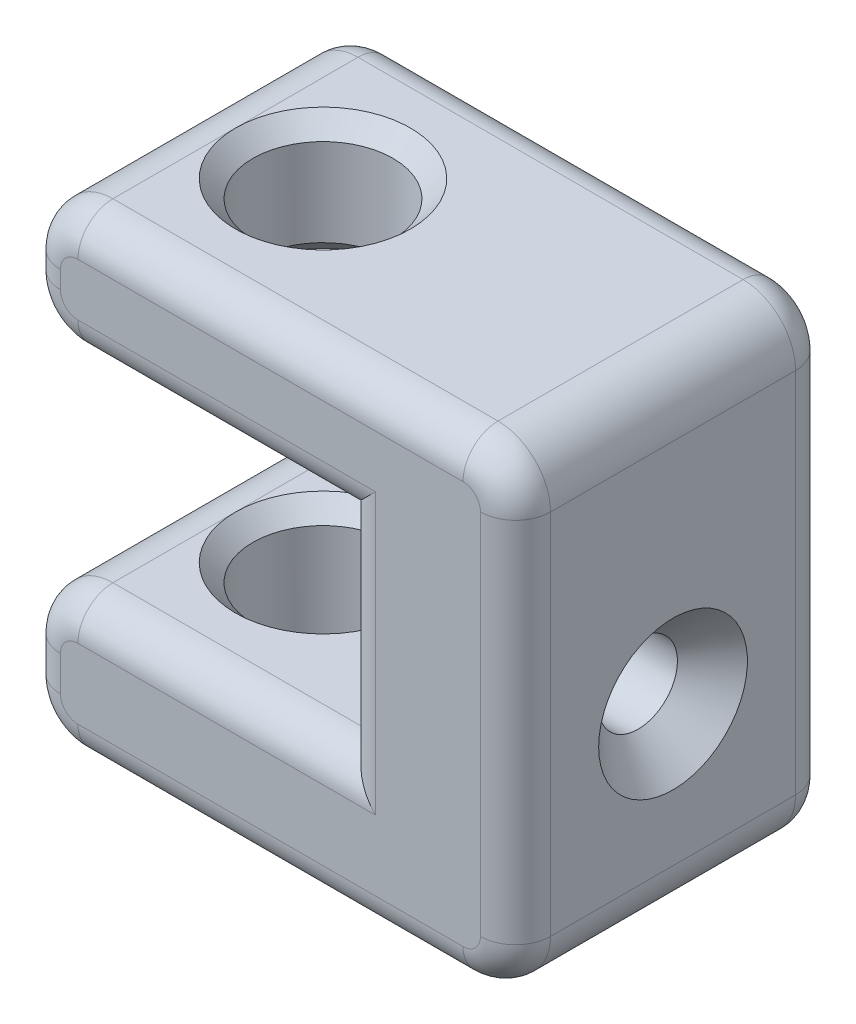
ISO-10303-21;
HEADER;
FILE_DESCRIPTION(('STEP AP214'),'2;1');
FILE_NAME('part.step','',(''),(''),'','','');
FILE_SCHEMA(('AUTOMOTIVE_DESIGN { 1 0 10303 214 1 1 1 1 }'));
ENDSEC;
DATA;
#1=APPLICATION_CONTEXT('core data for automotive mechanical design processes');
#2=APPLICATION_PROTOCOL_DEFINITION('international standard','automotive_design',2000,#1);
#3=PRODUCT_CONTEXT('',#1,'mechanical');
#4=PRODUCT('Part','Part','',(#3));
#5=PRODUCT_RELATED_PRODUCT_CATEGORY('part','',(#4));
#6=PRODUCT_DEFINITION_FORMATION('','',#4);
#7=PRODUCT_DEFINITION_CONTEXT('part definition',#1,'design');
#8=PRODUCT_DEFINITION('design','',#6,#7);
#9=PRODUCT_DEFINITION_SHAPE('','',#8);
#10=(LENGTH_UNIT() NAMED_UNIT(*) SI_UNIT(.MILLI.,.METRE.));
#11=(NAMED_UNIT(*) PLANE_ANGLE_UNIT() SI_UNIT($,.RADIAN.));
#12=(NAMED_UNIT(*) SI_UNIT($,.STERADIAN.) SOLID_ANGLE_UNIT());
#13=UNCERTAINTY_MEASURE_WITH_UNIT(LENGTH_MEASURE(1.E-05),#10,'distance_accuracy_value','');
#14=(GEOMETRIC_REPRESENTATION_CONTEXT(3) GLOBAL_UNCERTAINTY_ASSIGNED_CONTEXT((#13)) GLOBAL_UNIT_ASSIGNED_CONTEXT((#10,
#11,#12)) REPRESENTATION_CONTEXT('',''));
#15=CARTESIAN_POINT('',(0.,0.,0.));
#16=DIRECTION('',(0.,0.,1.));
#17=DIRECTION('',(1.,0.,0.));
#18=AXIS2_PLACEMENT_3D('',#15,#16,#17);
#19=CARTESIAN_POINT('',(0.,7.,18.));
#20=DIRECTION('',(1.,0.,0.));
#21=DIRECTION('',(0.,1.,0.));
#22=AXIS2_PLACEMENT_3D('',#19,#20,#21);
#23=PLANE('',#22);
#24=DIRECTION('',(0.,0.,-1.));
#25=VECTOR('',#24,1.);
#26=CARTESIAN_POINT('',(0.,4.,18.));
#27=LINE('',#26,#25);
#28=CARTESIAN_POINT('',(0.,4.,16.));
#29=VERTEX_POINT('',#28);
#30=CARTESIAN_POINT('',(0.,4.,2.));
#31=VERTEX_POINT('',#30);
#32=EDGE_CURVE('E263',#29,#31,#27,.T.);
#33=ORIENTED_EDGE('',*,*,#32,.T.);
#34=DIRECTION('',(0.,-1.,0.));
#35=VECTOR('',#34,1.);
#36=CARTESIAN_POINT('',(0.,7.,2.));
#37=LINE('',#36,#35);
#38=CARTESIAN_POINT('',(0.,3.,2.));
#39=VERTEX_POINT('',#38);
#40=EDGE_CURVE('E415',#31,#39,#37,.T.);
#41=ORIENTED_EDGE('',*,*,#40,.T.);
#42=DIRECTION('',(0.,0.,-1.));
#43=VECTOR('',#42,1.);
#44=CARTESIAN_POINT('',(0.,3.,18.));
#45=LINE('',#44,#43);
#46=CARTESIAN_POINT('',(0.,3.,16.));
#47=VERTEX_POINT('',#46);
#48=EDGE_CURVE('E261',#39,#47,#45,.F.);
#49=ORIENTED_EDGE('',*,*,#48,.T.);
#50=DIRECTION('',(0.,-1.,0.));
#51=VECTOR('',#50,1.);
#52=CARTESIAN_POINT('',(0.,4.,16.));
#53=LINE('',#52,#51);
#54=EDGE_CURVE('E331',#47,#29,#53,.F.);
#55=ORIENTED_EDGE('',*,*,#54,.T.);
#56=EDGE_LOOP('',(#33,#41,#49,#55));
#57=FACE_BOUND('',#56,.T.);
#58=ADVANCED_FACE('F33',(#57),#23,.F.);
#59=CARTESIAN_POINT('',(0.,0.,18.));
#60=DIRECTION('',(0.,1.,0.));
#61=DIRECTION('',(0.,0.,1.));
#62=AXIS2_PLACEMENT_3D('',#59,#60,#61);
#63=PLANE('',#62);
#64=DIRECTION('',(0.,0.,-1.));
#65=VECTOR('',#64,1.);
#66=CARTESIAN_POINT('',(3.,0.,18.));
#67=LINE('',#66,#65);
#68=CARTESIAN_POINT('',(3.,0.,9.));
#69=VERTEX_POINT('',#68);
#70=CARTESIAN_POINT('',(3.,0.,2.));
#71=VERTEX_POINT('',#70);
#72=EDGE_CURVE('E266',#69,#71,#67,.T.);
#73=ORIENTED_EDGE('',*,*,#72,.T.);
#74=DIRECTION('',(1.,0.,0.));
#75=VECTOR('',#74,1.);
#76=CARTESIAN_POINT('',(0.,0.,2.));
#77=LINE('',#76,#75);
#78=CARTESIAN_POINT('',(18.,0.,2.));
#79=VERTEX_POINT('',#78);
#80=EDGE_CURVE('E419',#71,#79,#77,.T.);
#81=ORIENTED_EDGE('',*,*,#80,.T.);
#82=DIRECTION('',(0.,0.,-1.));
#83=VECTOR('',#82,1.);
#84=CARTESIAN_POINT('',(18.,0.,18.));
#85=LINE('',#84,#83);
#86=CARTESIAN_POINT('',(18.,0.,16.));
#87=VERTEX_POINT('',#86);
#88=EDGE_CURVE('E539',#87,#79,#85,.T.);
#89=ORIENTED_EDGE('',*,*,#88,.F.);
#90=DIRECTION('',(1.,0.,0.));
#91=VECTOR('',#90,1.);
#92=CARTESIAN_POINT('',(3.,0.,16.));
#93=LINE('',#92,#91);
#94=CARTESIAN_POINT('',(3.,0.,16.));
#95=VERTEX_POINT('',#94);
#96=EDGE_CURVE('E326',#87,#95,#93,.F.);
#97=ORIENTED_EDGE('',*,*,#96,.T.);
#98=DIRECTION('',(0.,0.,-1.));
#99=VECTOR('',#98,1.);
#100=CARTESIAN_POINT('',(3.,0.,18.));
#101=LINE('',#100,#99);
#102=EDGE_CURVE('E269',#95,#69,#101,.T.);
#103=ORIENTED_EDGE('',*,*,#102,.T.);
#104=CARTESIAN_POINT('',(8.,0.,9.));
#105=DIRECTION('',(0.,1.,0.));
#106=DIRECTION('',(0.,0.,1.));
#107=AXIS2_PLACEMENT_3D('',#104,#105,#106);
#108=CIRCLE('',#107,5.);
#109=EDGE_CURVE('E566',#69,#69,#108,.T.);
#110=ORIENTED_EDGE('',*,*,#109,.T.);
#111=EDGE_LOOP('',(#73,#81,#89,#97,#103,#110));
#112=FACE_BOUND('',#111,.T.);
#113=ADVANCED_FACE('F544',(#112),#63,.F.);
#114=CARTESIAN_POINT('',(18.,0.,18.));
#115=DIRECTION('',(1.,0.,0.));
#116=DIRECTION('',(0.,1.,0.));
#117=AXIS2_PLACEMENT_3D('',#114,#115,#116);
#118=PLANE('',#117);
#119=CARTESIAN_POINT('',(18.,-9.,9.));
#120=DIRECTION('',(1.,0.,0.));
#121=DIRECTION('',(0.,1.,0.));
#122=AXIS2_PLACEMENT_3D('',#119,#120,#121);
#123=CIRCLE('',#122,2.25);
#124=CARTESIAN_POINT('',(18.,-6.75,9.));
#125=VERTEX_POINT('',#124);
#126=EDGE_CURVE('E384',#125,#125,#123,.T.);
#127=ORIENTED_EDGE('',*,*,#126,.T.);
#128=EDGE_LOOP('',(#127));
#129=FACE_BOUND('',#128,.T.);
#130=ORIENTED_EDGE('',*,*,#88,.T.);
#131=DIRECTION('',(0.,-1.,0.));
#132=VECTOR('',#131,1.);
#133=CARTESIAN_POINT('',(18.,0.,2.));
#134=LINE('',#133,#132);
#135=CARTESIAN_POINT('',(18.,-12.,2.));
#136=VERTEX_POINT('',#135);
#137=EDGE_CURVE('E421',#79,#136,#134,.T.);
#138=ORIENTED_EDGE('',*,*,#137,.T.);
#139=DIRECTION('',(0.,0.,-1.));
#140=VECTOR('',#139,1.);
#141=CARTESIAN_POINT('',(18.,-12.,18.));
#142=LINE('',#141,#140);
#143=CARTESIAN_POINT('',(18.,-12.,16.));
#144=VERTEX_POINT('',#143);
#145=EDGE_CURVE('E541',#144,#136,#142,.T.);
#146=ORIENTED_EDGE('',*,*,#145,.F.);
#147=DIRECTION('',(0.,-1.,0.));
#148=VECTOR('',#147,1.);
#149=CARTESIAN_POINT('',(18.,0.,16.));
#150=LINE('',#149,#148);
#151=EDGE_CURVE('E324',#144,#87,#150,.F.);
#152=ORIENTED_EDGE('',*,*,#151,.T.);
#153=EDGE_LOOP('',(#130,#138,#146,#152));
#154=FACE_BOUND('',#153,.T.);
#155=ADVANCED_FACE('F538',(#129,#154),#118,.F.);
#156=CARTESIAN_POINT('',(18.,-12.,18.));
#157=DIRECTION('',(0.,-1.,0.));
#158=DIRECTION('',(0.,0.,-1.));
#159=AXIS2_PLACEMENT_3D('',#156,#157,#158);
#160=PLANE('',#159);
#161=ORIENTED_EDGE('',*,*,#145,.T.);
#162=DIRECTION('',(-1.,0.,0.));
#163=VECTOR('',#162,1.);
#164=CARTESIAN_POINT('',(18.,-12.,2.));
#165=LINE('',#164,#163);
#166=CARTESIAN_POINT('',(3.,-12.,2.));
#167=VERTEX_POINT('',#166);
#168=EDGE_CURVE('E423',#136,#167,#165,.T.);
#169=ORIENTED_EDGE('',*,*,#168,.T.);
#170=DIRECTION('',(0.,0.,-1.));
#171=VECTOR('',#170,1.);
#172=CARTESIAN_POINT('',(3.,-12.,18.));
#173=LINE('',#172,#171);
#174=CARTESIAN_POINT('',(3.,-12.,9.));
#175=VERTEX_POINT('',#174);
#176=EDGE_CURVE('E279',#167,#175,#173,.F.);
#177=ORIENTED_EDGE('',*,*,#176,.T.);
#178=CARTESIAN_POINT('',(8.,-12.,9.));
#179=DIRECTION('',(0.,-1.,0.));
#180=DIRECTION('',(0.,0.,-1.));
#181=AXIS2_PLACEMENT_3D('',#178,#179,#180);
#182=CIRCLE('',#181,5.);
#183=EDGE_CURVE('E526',#175,#175,#182,.T.);
#184=ORIENTED_EDGE('',*,*,#183,.T.);
#185=DIRECTION('',(0.,0.,-1.));
#186=VECTOR('',#185,1.);
#187=CARTESIAN_POINT('',(3.,-12.,18.));
#188=LINE('',#187,#186);
#189=CARTESIAN_POINT('',(3.,-12.,16.));
#190=VERTEX_POINT('',#189);
#191=EDGE_CURVE('E276',#175,#190,#188,.F.);
#192=ORIENTED_EDGE('',*,*,#191,.T.);
#193=DIRECTION('',(-1.,0.,0.));
#194=VECTOR('',#193,1.);
#195=CARTESIAN_POINT('',(18.,-12.,16.));
#196=LINE('',#195,#194);
#197=EDGE_CURVE('E322',#190,#144,#196,.F.);
#198=ORIENTED_EDGE('',*,*,#197,.T.);
#199=EDGE_LOOP('',(#161,#169,#177,#184,#192,#198));
#200=FACE_BOUND('',#199,.T.);
#201=ADVANCED_FACE('F523',(#200),#160,.F.);
#202=CARTESIAN_POINT('',(0.,-12.,18.));
#203=DIRECTION('',(1.,0.,0.));
#204=DIRECTION('',(0.,1.,0.));
#205=AXIS2_PLACEMENT_3D('',#202,#203,#204);
#206=PLANE('',#205);
#207=DIRECTION('',(0.,0.,-1.));
#208=VECTOR('',#207,1.);
#209=CARTESIAN_POINT('',(0.,-15.,18.));
#210=LINE('',#209,#208);
#211=CARTESIAN_POINT('',(0.,-15.,16.));
#212=VERTEX_POINT('',#211);
#213=CARTESIAN_POINT('',(0.,-15.,2.));
#214=VERTEX_POINT('',#213);
#215=EDGE_CURVE('E273',#212,#214,#210,.T.);
#216=ORIENTED_EDGE('',*,*,#215,.T.);
#217=DIRECTION('',(0.,-1.,0.));
#218=VECTOR('',#217,1.);
#219=CARTESIAN_POINT('',(0.,-12.,2.));
#220=LINE('',#219,#218);
#221=CARTESIAN_POINT('',(0.,-17.,2.));
#222=VERTEX_POINT('',#221);
#223=EDGE_CURVE('E427',#214,#222,#220,.T.);
#224=ORIENTED_EDGE('',*,*,#223,.T.);
#225=DIRECTION('',(0.,0.,-1.));
#226=VECTOR('',#225,1.);
#227=CARTESIAN_POINT('',(0.,-17.,18.));
#228=LINE('',#227,#226);
#229=CARTESIAN_POINT('',(0.,-17.,16.));
#230=VERTEX_POINT('',#229);
#231=EDGE_CURVE('E271',#222,#230,#228,.F.);
#232=ORIENTED_EDGE('',*,*,#231,.T.);
#233=DIRECTION('',(0.,-1.,0.));
#234=VECTOR('',#233,1.);
#235=CARTESIAN_POINT('',(0.,-15.,16.));
#236=LINE('',#235,#234);
#237=EDGE_CURVE('E318',#230,#212,#236,.F.);
#238=ORIENTED_EDGE('',*,*,#237,.T.);
#239=EDGE_LOOP('',(#216,#224,#232,#238));
#240=FACE_BOUND('',#239,.T.);
#241=ADVANCED_FACE('F488',(#240),#206,.F.);
#242=CARTESIAN_POINT('',(0.,-20.,18.));
#243=DIRECTION('',(0.,1.,0.));
#244=DIRECTION('',(0.,0.,1.));
#245=AXIS2_PLACEMENT_3D('',#242,#243,#244);
#246=PLANE('',#245);
#247=DIRECTION('',(0.,0.,-1.));
#248=VECTOR('',#247,1.);
#249=CARTESIAN_POINT('',(3.,-20.,18.));
#250=LINE('',#249,#248);
#251=CARTESIAN_POINT('',(3.,-20.,9.));
#252=VERTEX_POINT('',#251);
#253=CARTESIAN_POINT('',(3.,-20.,2.));
#254=VERTEX_POINT('',#253);
#255=EDGE_CURVE('E254',#252,#254,#250,.T.);
#256=ORIENTED_EDGE('',*,*,#255,.T.);
#257=DIRECTION('',(1.,0.,0.));
#258=VECTOR('',#257,1.);
#259=CARTESIAN_POINT('',(0.,-20.,2.));
#260=LINE('',#259,#258);
#261=CARTESIAN_POINT('',(25.,-20.,2.));
#262=VERTEX_POINT('',#261);
#263=EDGE_CURVE('E431',#254,#262,#260,.T.);
#264=ORIENTED_EDGE('',*,*,#263,.T.);
#265=DIRECTION('',(0.,0.,-1.));
#266=VECTOR('',#265,1.);
#267=CARTESIAN_POINT('',(25.,-20.,18.));
#268=LINE('',#267,#266);
#269=CARTESIAN_POINT('',(25.,-20.,16.));
#270=VERTEX_POINT('',#269);
#271=EDGE_CURVE('E259',#262,#270,#268,.F.);
#272=ORIENTED_EDGE('',*,*,#271,.T.);
#273=DIRECTION('',(1.,0.,0.));
#274=VECTOR('',#273,1.);
#275=CARTESIAN_POINT('',(3.,-20.,16.));
#276=LINE('',#275,#274);
#277=CARTESIAN_POINT('',(3.,-20.,16.));
#278=VERTEX_POINT('',#277);
#279=EDGE_CURVE('E313',#270,#278,#276,.F.);
#280=ORIENTED_EDGE('',*,*,#279,.T.);
#281=DIRECTION('',(0.,0.,-1.));
#282=VECTOR('',#281,1.);
#283=CARTESIAN_POINT('',(3.,-20.,18.));
#284=LINE('',#283,#282);
#285=EDGE_CURVE('E257',#278,#252,#284,.T.);
#286=ORIENTED_EDGE('',*,*,#285,.T.);
#287=CARTESIAN_POINT('',(8.,-20.,9.));
#288=DIRECTION('',(0.,1.,0.));
#289=DIRECTION('',(0.,0.,1.));
#290=AXIS2_PLACEMENT_3D('',#287,#288,#289);
#291=CIRCLE('',#290,5.00000000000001);
#292=EDGE_CURVE('E547',#252,#252,#291,.T.);
#293=ORIENTED_EDGE('',*,*,#292,.T.);
#294=EDGE_LOOP('',(#256,#264,#272,#280,#286,#293));
#295=FACE_BOUND('',#294,.T.);
#296=ADVANCED_FACE('F649',(#295),#246,.F.);
#297=CARTESIAN_POINT('',(28.,-20.,18.));
#298=DIRECTION('',(-1.,0.,0.));
#299=DIRECTION('',(0.,0.,1.));
#300=AXIS2_PLACEMENT_3D('',#297,#298,#299);
#301=PLANE('',#300);
#302=CARTESIAN_POINT('',(28.,-9.,9.));
#303=DIRECTION('',(-1.,0.,0.));
#304=DIRECTION('',(0.,0.,1.));
#305=AXIS2_PLACEMENT_3D('',#302,#303,#304);
#306=CIRCLE('',#305,4.25000000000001);
#307=CARTESIAN_POINT('',(28.,-9.,13.25));
#308=VERTEX_POINT('',#307);
#309=EDGE_CURVE('E247',#308,#308,#306,.T.);
#310=ORIENTED_EDGE('',*,*,#309,.T.);
#311=EDGE_LOOP('',(#310));
#312=FACE_BOUND('',#311,.T.);
#313=DIRECTION('',(0.,0.,-1.));
#314=VECTOR('',#313,1.);
#315=CARTESIAN_POINT('',(28.,-17.,18.));
#316=LINE('',#315,#314);
#317=CARTESIAN_POINT('',(28.,-17.,16.));
#318=VERTEX_POINT('',#317);
#319=CARTESIAN_POINT('',(28.,-17.,2.));
#320=VERTEX_POINT('',#319);
#321=EDGE_CURVE('E245',#318,#320,#316,.T.);
#322=ORIENTED_EDGE('',*,*,#321,.T.);
#323=DIRECTION('',(0.,1.,0.));
#324=VECTOR('',#323,1.);
#325=CARTESIAN_POINT('',(28.,-20.,2.));
#326=LINE('',#325,#324);
#327=CARTESIAN_POINT('',(28.,4.,2.));
#328=VERTEX_POINT('',#327);
#329=EDGE_CURVE('E57',#320,#328,#326,.T.);
#330=ORIENTED_EDGE('',*,*,#329,.T.);
#331=DIRECTION('',(0.,0.,-1.));
#332=VECTOR('',#331,1.);
#333=CARTESIAN_POINT('',(28.,4.,18.));
#334=LINE('',#333,#332);
#335=CARTESIAN_POINT('',(28.,4.,16.));
#336=VERTEX_POINT('',#335);
#337=EDGE_CURVE('E252',#328,#336,#334,.F.);
#338=ORIENTED_EDGE('',*,*,#337,.T.);
#339=DIRECTION('',(0.,1.,0.));
#340=VECTOR('',#339,1.);
#341=CARTESIAN_POINT('',(28.,-17.,16.));
#342=LINE('',#341,#340);
#343=EDGE_CURVE('E340',#336,#318,#342,.F.);
#344=ORIENTED_EDGE('',*,*,#343,.T.);
#345=EDGE_LOOP('',(#322,#330,#338,#344));
#346=FACE_BOUND('',#345,.T.);
#347=ADVANCED_FACE('F588',(#312,#346),#301,.F.);
#348=CARTESIAN_POINT('',(28.,7.,18.));
#349=DIRECTION('',(0.,-1.,0.));
#350=DIRECTION('',(1.,0.,0.));
#351=AXIS2_PLACEMENT_3D('',#348,#349,#350);
#352=PLANE('',#351);
#353=DIRECTION('',(0.,0.,-1.));
#354=VECTOR('',#353,1.);
#355=CARTESIAN_POINT('',(25.,7.,18.));
#356=LINE('',#355,#354);
#357=CARTESIAN_POINT('',(25.,7.,16.));
#358=VERTEX_POINT('',#357);
#359=CARTESIAN_POINT('',(25.,7.,2.));
#360=VERTEX_POINT('',#359);
#361=EDGE_CURVE('E242',#358,#360,#356,.T.);
#362=ORIENTED_EDGE('',*,*,#361,.T.);
#363=DIRECTION('',(-1.,0.,0.));
#364=VECTOR('',#363,1.);
#365=CARTESIAN_POINT('',(28.,7.,2.));
#366=LINE('',#365,#364);
#367=CARTESIAN_POINT('',(3.,7.,2.));
#368=VERTEX_POINT('',#367);
#369=EDGE_CURVE('E11',#360,#368,#366,.T.);
#370=ORIENTED_EDGE('',*,*,#369,.T.);
#371=DIRECTION('',(0.,0.,-1.));
#372=VECTOR('',#371,1.);
#373=CARTESIAN_POINT('',(3.,7.,18.));
#374=LINE('',#373,#372);
#375=CARTESIAN_POINT('',(3.,7.,9.));
#376=VERTEX_POINT('',#375);
#377=EDGE_CURVE('E232',#368,#376,#374,.F.);
#378=ORIENTED_EDGE('',*,*,#377,.T.);
#379=CARTESIAN_POINT('',(8.,7.,9.));
#380=DIRECTION('',(0.,-1.,0.));
#381=DIRECTION('',(1.,0.,0.));
#382=AXIS2_PLACEMENT_3D('',#379,#380,#381);
#383=CIRCLE('',#382,5.00000000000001);
#384=EDGE_CURVE('E236',#376,#376,#383,.T.);
#385=ORIENTED_EDGE('',*,*,#384,.T.);
#386=DIRECTION('',(0.,0.,-1.));
#387=VECTOR('',#386,1.);
#388=CARTESIAN_POINT('',(3.,7.,18.));
#389=LINE('',#388,#387);
#390=CARTESIAN_POINT('',(3.,7.,16.));
#391=VERTEX_POINT('',#390);
#392=EDGE_CURVE('E243',#376,#391,#389,.F.);
#393=ORIENTED_EDGE('',*,*,#392,.T.);
#394=DIRECTION('',(-1.,0.,0.));
#395=VECTOR('',#394,1.);
#396=CARTESIAN_POINT('',(25.,7.,16.));
#397=LINE('',#396,#395);
#398=EDGE_CURVE('E335',#391,#358,#397,.F.);
#399=ORIENTED_EDGE('',*,*,#398,.T.);
#400=EDGE_LOOP('',(#362,#370,#378,#385,#393,#399));
#401=FACE_BOUND('',#400,.T.);
#402=ADVANCED_FACE('F233',(#401),#352,.F.);
#403=CARTESIAN_POINT('',(0.,0.,18.));
#404=DIRECTION('',(0.,0.,1.));
#405=DIRECTION('',(1.,0.,0.));
#406=AXIS2_PLACEMENT_3D('',#403,#404,#405);
#407=PLANE('',#406);
#408=DIRECTION('',(1.,0.,0.));
#409=VECTOR('',#408,1.);
#410=CARTESIAN_POINT('',(25.,-18.,18.));
#411=LINE('',#410,#409);
#412=CARTESIAN_POINT('',(3.,-18.,18.));
#413=VERTEX_POINT('',#412);
#414=CARTESIAN_POINT('',(25.,-18.,18.));
#415=VERTEX_POINT('',#414);
#416=EDGE_CURVE('E305',#413,#415,#411,.T.);
#417=ORIENTED_EDGE('',*,*,#416,.T.);
#418=CARTESIAN_POINT('',(25.,-17.,18.));
#419=DIRECTION('',(0.,0.,1.));
#420=DIRECTION('',(1.,0.,0.));
#421=AXIS2_PLACEMENT_3D('',#418,#419,#420);
#422=CIRCLE('',#421,1.);
#423=CARTESIAN_POINT('',(26.,-17.,18.));
#424=VERTEX_POINT('',#423);
#425=EDGE_CURVE('E307',#415,#424,#422,.T.);
#426=ORIENTED_EDGE('',*,*,#425,.T.);
#427=DIRECTION('',(0.,1.,0.));
#428=VECTOR('',#427,1.);
#429=CARTESIAN_POINT('',(26.,4.,18.));
#430=LINE('',#429,#428);
#431=CARTESIAN_POINT('',(26.,4.,18.));
#432=VERTEX_POINT('',#431);
#433=EDGE_CURVE('E281',#424,#432,#430,.T.);
#434=ORIENTED_EDGE('',*,*,#433,.T.);
#435=CARTESIAN_POINT('',(25.,4.,18.));
#436=DIRECTION('',(0.,0.,1.));
#437=DIRECTION('',(1.,0.,0.));
#438=AXIS2_PLACEMENT_3D('',#435,#436,#437);
#439=CIRCLE('',#438,1.);
#440=CARTESIAN_POINT('',(25.,5.,18.));
#441=VERTEX_POINT('',#440);
#442=EDGE_CURVE('E283',#432,#441,#439,.T.);
#443=ORIENTED_EDGE('',*,*,#442,.T.);
#444=DIRECTION('',(-1.,0.,0.));
#445=VECTOR('',#444,1.);
#446=CARTESIAN_POINT('',(3.,5.,18.));
#447=LINE('',#446,#445);
#448=CARTESIAN_POINT('',(3.,5.,18.));
#449=VERTEX_POINT('',#448);
#450=EDGE_CURVE('E285',#441,#449,#447,.T.);
#451=ORIENTED_EDGE('',*,*,#450,.T.);
#452=CARTESIAN_POINT('',(3.,4.,18.));
#453=DIRECTION('',(0.,0.,1.));
#454=DIRECTION('',(1.,0.,0.));
#455=AXIS2_PLACEMENT_3D('',#452,#453,#454);
#456=CIRCLE('',#455,1.);
#457=CARTESIAN_POINT('',(2.,4.,18.));
#458=VERTEX_POINT('',#457);
#459=EDGE_CURVE('E287',#449,#458,#456,.T.);
#460=ORIENTED_EDGE('',*,*,#459,.T.);
#461=DIRECTION('',(0.,-1.,0.));
#462=VECTOR('',#461,1.);
#463=CARTESIAN_POINT('',(2.,3.,18.));
#464=LINE('',#463,#462);
#465=CARTESIAN_POINT('',(2.,3.,18.));
#466=VERTEX_POINT('',#465);
#467=EDGE_CURVE('E289',#458,#466,#464,.T.);
#468=ORIENTED_EDGE('',*,*,#467,.T.);
#469=CARTESIAN_POINT('',(3.,3.,18.));
#470=DIRECTION('',(0.,0.,1.));
#471=DIRECTION('',(1.,0.,0.));
#472=AXIS2_PLACEMENT_3D('',#469,#470,#471);
#473=CIRCLE('',#472,1.);
#474=CARTESIAN_POINT('',(3.,2.,18.));
#475=VERTEX_POINT('',#474);
#476=EDGE_CURVE('E291',#466,#475,#473,.T.);
#477=ORIENTED_EDGE('',*,*,#476,.T.);
#478=DIRECTION('',(1.,0.,0.));
#479=VECTOR('',#478,1.);
#480=CARTESIAN_POINT('',(18.,2.,18.));
#481=LINE('',#480,#479);
#482=CARTESIAN_POINT('',(20.,2.,18.));
#483=VERTEX_POINT('',#482);
#484=EDGE_CURVE('E293',#475,#483,#481,.T.);
#485=ORIENTED_EDGE('',*,*,#484,.T.);
#486=DIRECTION('',(0.,-1.,0.));
#487=VECTOR('',#486,1.);
#488=CARTESIAN_POINT('',(20.,-12.,18.));
#489=LINE('',#488,#487);
#490=CARTESIAN_POINT('',(20.,-14.,18.));
#491=VERTEX_POINT('',#490);
#492=EDGE_CURVE('E295',#483,#491,#489,.T.);
#493=ORIENTED_EDGE('',*,*,#492,.T.);
#494=DIRECTION('',(-1.,0.,0.));
#495=VECTOR('',#494,1.);
#496=CARTESIAN_POINT('',(3.,-14.,18.));
#497=LINE('',#496,#495);
#498=CARTESIAN_POINT('',(3.,-14.,18.));
#499=VERTEX_POINT('',#498);
#500=EDGE_CURVE('E297',#491,#499,#497,.T.);
#501=ORIENTED_EDGE('',*,*,#500,.T.);
#502=CARTESIAN_POINT('',(3.,-15.,18.));
#503=DIRECTION('',(0.,0.,1.));
#504=DIRECTION('',(1.,0.,0.));
#505=AXIS2_PLACEMENT_3D('',#502,#503,#504);
#506=CIRCLE('',#505,1.);
#507=CARTESIAN_POINT('',(2.,-15.,18.));
#508=VERTEX_POINT('',#507);
#509=EDGE_CURVE('E299',#499,#508,#506,.T.);
#510=ORIENTED_EDGE('',*,*,#509,.T.);
#511=DIRECTION('',(0.,-1.,0.));
#512=VECTOR('',#511,1.);
#513=CARTESIAN_POINT('',(2.,-17.,18.));
#514=LINE('',#513,#512);
#515=CARTESIAN_POINT('',(2.,-17.,18.));
#516=VERTEX_POINT('',#515);
#517=EDGE_CURVE('E301',#508,#516,#514,.T.);
#518=ORIENTED_EDGE('',*,*,#517,.T.);
#519=CARTESIAN_POINT('',(3.,-17.,18.));
#520=DIRECTION('',(0.,0.,1.));
#521=DIRECTION('',(1.,0.,0.));
#522=AXIS2_PLACEMENT_3D('',#519,#520,#521);
#523=CIRCLE('',#522,1.);
#524=EDGE_CURVE('E303',#516,#413,#523,.T.);
#525=ORIENTED_EDGE('',*,*,#524,.T.);
#526=EDGE_LOOP('',(#417,#426,#434,#443,#451,#460,#468,#477,#485,#493,#501,#510,#518,#525));
#527=FACE_BOUND('',#526,.T.);
#528=ADVANCED_FACE('F507',(#527),#407,.T.);
#529=CARTESIAN_POINT('',(0.,0.,0.));
#530=DIRECTION('',(0.,0.,1.));
#531=DIRECTION('',(1.,0.,0.));
#532=AXIS2_PLACEMENT_3D('',#529,#530,#531);
#533=PLANE('',#532);
#534=DIRECTION('',(0.,-1.,0.));
#535=VECTOR('',#534,1.);
#536=CARTESIAN_POINT('',(2.,0.,0.));
#537=LINE('',#536,#535);
#538=CARTESIAN_POINT('',(2.,3.,0.));
#539=VERTEX_POINT('',#538);
#540=CARTESIAN_POINT('',(2.,4.,0.));
#541=VERTEX_POINT('',#540);
#542=EDGE_CURVE('E408',#539,#541,#537,.F.);
#543=ORIENTED_EDGE('',*,*,#542,.T.);
#544=CARTESIAN_POINT('',(3.,4.,0.));
#545=DIRECTION('',(0.,0.,1.));
#546=DIRECTION('',(1.,0.,0.));
#547=AXIS2_PLACEMENT_3D('',#544,#545,#546);
#548=CIRCLE('',#547,1.);
#549=CARTESIAN_POINT('',(3.,5.,0.));
#550=VERTEX_POINT('',#549);
#551=EDGE_CURVE('E410',#541,#550,#548,.F.);
#552=ORIENTED_EDGE('',*,*,#551,.T.);
#553=DIRECTION('',(-1.,0.,0.));
#554=VECTOR('',#553,1.);
#555=CARTESIAN_POINT('',(0.,5.,0.));
#556=LINE('',#555,#554);
#557=CARTESIAN_POINT('',(25.,5.,0.));
#558=VERTEX_POINT('',#557);
#559=EDGE_CURVE('E342',#550,#558,#556,.F.);
#560=ORIENTED_EDGE('',*,*,#559,.T.);
#561=CARTESIAN_POINT('',(25.,4.,0.));
#562=DIRECTION('',(0.,0.,1.));
#563=DIRECTION('',(1.,0.,0.));
#564=AXIS2_PLACEMENT_3D('',#561,#562,#563);
#565=CIRCLE('',#564,1.);
#566=CARTESIAN_POINT('',(26.,4.,0.));
#567=VERTEX_POINT('',#566);
#568=EDGE_CURVE('E386',#558,#567,#565,.F.);
#569=ORIENTED_EDGE('',*,*,#568,.T.);
#570=DIRECTION('',(0.,1.,0.));
#571=VECTOR('',#570,1.);
#572=CARTESIAN_POINT('',(26.,0.,0.));
#573=LINE('',#572,#571);
#574=CARTESIAN_POINT('',(26.,-17.,0.));
#575=VERTEX_POINT('',#574);
#576=EDGE_CURVE('E388',#567,#575,#573,.F.);
#577=ORIENTED_EDGE('',*,*,#576,.T.);
#578=CARTESIAN_POINT('',(25.,-17.,0.));
#579=DIRECTION('',(0.,0.,1.));
#580=DIRECTION('',(1.,0.,0.));
#581=AXIS2_PLACEMENT_3D('',#578,#579,#580);
#582=CIRCLE('',#581,1.);
#583=CARTESIAN_POINT('',(25.,-18.,0.));
#584=VERTEX_POINT('',#583);
#585=EDGE_CURVE('E390',#575,#584,#582,.F.);
#586=ORIENTED_EDGE('',*,*,#585,.T.);
#587=DIRECTION('',(1.,0.,0.));
#588=VECTOR('',#587,1.);
#589=CARTESIAN_POINT('',(0.,-18.,0.));
#590=LINE('',#589,#588);
#591=CARTESIAN_POINT('',(3.,-18.,0.));
#592=VERTEX_POINT('',#591);
#593=EDGE_CURVE('E392',#584,#592,#590,.F.);
#594=ORIENTED_EDGE('',*,*,#593,.T.);
#595=CARTESIAN_POINT('',(3.,-17.,0.));
#596=DIRECTION('',(0.,0.,1.));
#597=DIRECTION('',(1.,0.,0.));
#598=AXIS2_PLACEMENT_3D('',#595,#596,#597);
#599=CIRCLE('',#598,1.);
#600=CARTESIAN_POINT('',(2.,-17.,0.));
#601=VERTEX_POINT('',#600);
#602=EDGE_CURVE('E394',#592,#601,#599,.F.);
#603=ORIENTED_EDGE('',*,*,#602,.T.);
#604=DIRECTION('',(0.,-1.,0.));
#605=VECTOR('',#604,1.);
#606=CARTESIAN_POINT('',(2.,0.,0.));
#607=LINE('',#606,#605);
#608=CARTESIAN_POINT('',(2.,-15.,0.));
#609=VERTEX_POINT('',#608);
#610=EDGE_CURVE('E396',#601,#609,#607,.F.);
#611=ORIENTED_EDGE('',*,*,#610,.T.);
#612=CARTESIAN_POINT('',(3.,-15.,0.));
#613=DIRECTION('',(0.,0.,1.));
#614=DIRECTION('',(1.,0.,0.));
#615=AXIS2_PLACEMENT_3D('',#612,#613,#614);
#616=CIRCLE('',#615,1.);
#617=CARTESIAN_POINT('',(3.,-14.,0.));
#618=VERTEX_POINT('',#617);
#619=EDGE_CURVE('E398',#609,#618,#616,.F.);
#620=ORIENTED_EDGE('',*,*,#619,.T.);
#621=DIRECTION('',(-1.,0.,0.));
#622=VECTOR('',#621,1.);
#623=CARTESIAN_POINT('',(0.,-14.,0.));
#624=LINE('',#623,#622);
#625=CARTESIAN_POINT('',(20.,-14.,0.));
#626=VERTEX_POINT('',#625);
#627=EDGE_CURVE('E400',#618,#626,#624,.F.);
#628=ORIENTED_EDGE('',*,*,#627,.T.);
#629=DIRECTION('',(0.,-1.,0.));
#630=VECTOR('',#629,1.);
#631=CARTESIAN_POINT('',(20.,0.,0.));
#632=LINE('',#631,#630);
#633=CARTESIAN_POINT('',(20.,2.,0.));
#634=VERTEX_POINT('',#633);
#635=EDGE_CURVE('E402',#626,#634,#632,.F.);
#636=ORIENTED_EDGE('',*,*,#635,.T.);
#637=DIRECTION('',(1.,0.,0.));
#638=VECTOR('',#637,1.);
#639=CARTESIAN_POINT('',(0.,2.,0.));
#640=LINE('',#639,#638);
#641=CARTESIAN_POINT('',(3.,2.,0.));
#642=VERTEX_POINT('',#641);
#643=EDGE_CURVE('E404',#634,#642,#640,.F.);
#644=ORIENTED_EDGE('',*,*,#643,.T.);
#645=CARTESIAN_POINT('',(3.,3.,0.));
#646=DIRECTION('',(0.,0.,1.));
#647=DIRECTION('',(1.,0.,0.));
#648=AXIS2_PLACEMENT_3D('',#645,#646,#647);
#649=CIRCLE('',#648,1.);
#650=EDGE_CURVE('E406',#642,#539,#649,.F.);
#651=ORIENTED_EDGE('',*,*,#650,.T.);
#652=EDGE_LOOP('',(#543,#552,#560,#569,#577,#586,#594,#603,#611,#620,#628,#636,#644,#651));
#653=FACE_BOUND('',#652,.T.);
#654=ADVANCED_FACE('F701',(#653),#533,.F.);
#655=CARTESIAN_POINT('',(8.,-20.,9.));
#656=DIRECTION('',(0.,1.,0.));
#657=DIRECTION('',(-1.,0.,0.));
#658=AXIS2_PLACEMENT_3D('',#655,#656,#657);
#659=CYLINDRICAL_SURFACE('',#658,4.);
#660=CARTESIAN_POINT('',(8.,0.999999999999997,9.));
#661=DIRECTION('',(0.,1.,0.));
#662=DIRECTION('',(-1.,0.,0.));
#663=AXIS2_PLACEMENT_3D('',#660,#661,#662);
#664=CIRCLE('',#663,4.);
#665=CARTESIAN_POINT('',(4.,0.99999999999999,9.));
#666=VERTEX_POINT('',#665);
#667=EDGE_CURVE('E572',#666,#666,#664,.F.);
#668=ORIENTED_EDGE('',*,*,#667,.T.);
#669=EDGE_LOOP('',(#668));
#670=FACE_BOUND('',#669,.T.);
#671=CARTESIAN_POINT('',(8.,6.,9.));
#672=DIRECTION('',(0.,-1.,0.));
#673=DIRECTION('',(0.,0.,-1.));
#674=AXIS2_PLACEMENT_3D('',#671,#672,#673);
#675=CIRCLE('',#674,4.);
#676=CARTESIAN_POINT('',(8.,6.,5.));
#677=VERTEX_POINT('',#676);
#678=EDGE_CURVE('E568',#677,#677,#675,.F.);
#679=ORIENTED_EDGE('',*,*,#678,.T.);
#680=EDGE_LOOP('',(#679));
#681=FACE_BOUND('',#680,.T.);
#682=ADVANCED_FACE('F642',(#670,#681),#659,.F.);
#683=CARTESIAN_POINT('',(8.,-19.,9.));
#684=DIRECTION('',(0.,1.,0.));
#685=DIRECTION('',(0.,0.,1.));
#686=AXIS2_PLACEMENT_3D('',#683,#684,#685);
#687=CIRCLE('',#686,4.);
#688=CARTESIAN_POINT('',(8.,-19.,13.));
#689=VERTEX_POINT('',#688);
#690=EDGE_CURVE('E569',#689,#689,#687,.F.);
#691=ORIENTED_EDGE('',*,*,#690,.T.);
#692=EDGE_LOOP('',(#691));
#693=FACE_BOUND('',#692,.T.);
#694=CARTESIAN_POINT('',(8.,-13.,9.));
#695=DIRECTION('',(0.,-1.,0.));
#696=DIRECTION('',(0.,0.,-1.));
#697=AXIS2_PLACEMENT_3D('',#694,#695,#696);
#698=CIRCLE('',#697,4.);
#699=CARTESIAN_POINT('',(8.,-13.,5.));
#700=VERTEX_POINT('',#699);
#701=EDGE_CURVE('E575',#700,#700,#698,.F.);
#702=ORIENTED_EDGE('',*,*,#701,.T.);
#703=EDGE_LOOP('',(#702));
#704=FACE_BOUND('',#703,.T.);
#705=ADVANCED_FACE('F612',(#693,#704),#659,.F.);
#706=CARTESIAN_POINT('',(8.,-20.,9.));
#707=DIRECTION('',(0.,-1.,0.));
#708=DIRECTION('',(0.,0.,-1.));
#709=AXIS2_PLACEMENT_3D('',#706,#707,#708);
#710=CONICAL_SURFACE('',#709,5.00000000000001,0.785398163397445);
#711=ORIENTED_EDGE('',*,*,#690,.F.);
#712=EDGE_LOOP('',(#711));
#713=FACE_BOUND('',#712,.T.);
#714=ORIENTED_EDGE('',*,*,#292,.F.);
#715=EDGE_LOOP('',(#714));
#716=FACE_BOUND('',#715,.T.);
#717=ADVANCED_FACE('F625',(#713,#716),#710,.F.);
#718=CARTESIAN_POINT('',(8.,0.,9.));
#719=DIRECTION('',(0.,-1.,0.));
#720=DIRECTION('',(1.,0.,0.));
#721=AXIS2_PLACEMENT_3D('',#718,#719,#720);
#722=CONICAL_SURFACE('',#721,5.,0.785398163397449);
#723=ORIENTED_EDGE('',*,*,#667,.F.);
#724=EDGE_LOOP('',(#723));
#725=FACE_BOUND('',#724,.T.);
#726=ORIENTED_EDGE('',*,*,#109,.F.);
#727=EDGE_LOOP('',(#726));
#728=FACE_BOUND('',#727,.T.);
#729=ADVANCED_FACE('F617',(#725,#728),#722,.F.);
#730=CARTESIAN_POINT('',(8.,-12.,9.));
#731=DIRECTION('',(0.,1.,0.));
#732=DIRECTION('',(0.,0.,1.));
#733=AXIS2_PLACEMENT_3D('',#730,#731,#732);
#734=CONICAL_SURFACE('',#733,5.,0.785398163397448);
#735=ORIENTED_EDGE('',*,*,#701,.F.);
#736=EDGE_LOOP('',(#735));
#737=FACE_BOUND('',#736,.T.);
#738=ORIENTED_EDGE('',*,*,#183,.F.);
#739=EDGE_LOOP('',(#738));
#740=FACE_BOUND('',#739,.T.);
#741=ADVANCED_FACE('F614',(#737,#740),#734,.F.);
#742=CARTESIAN_POINT('',(8.,6.,9.));
#743=DIRECTION('',(0.,1.,0.));
#744=DIRECTION('',(0.,0.,1.));
#745=AXIS2_PLACEMENT_3D('',#742,#743,#744);
#746=CONICAL_SURFACE('',#745,4.,0.78539816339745);
#747=ORIENTED_EDGE('',*,*,#384,.F.);
#748=EDGE_LOOP('',(#747));
#749=FACE_BOUND('',#748,.T.);
#750=ORIENTED_EDGE('',*,*,#678,.F.);
#751=EDGE_LOOP('',(#750));
#752=FACE_BOUND('',#751,.T.);
#753=ADVANCED_FACE('F600',(#749,#752),#746,.F.);
#754=CARTESIAN_POINT('',(0.,-9.,9.));
#755=DIRECTION('',(1.,0.,0.));
#756=DIRECTION('',(0.,0.,-1.));
#757=AXIS2_PLACEMENT_3D('',#754,#755,#756);
#758=CYLINDRICAL_SURFACE('',#757,2.25);
#759=CARTESIAN_POINT('',(26.,-9.,9.));
#760=DIRECTION('',(-1.,0.,0.));
#761=DIRECTION('',(0.,0.,1.));
#762=AXIS2_PLACEMENT_3D('',#759,#760,#761);
#763=CIRCLE('',#762,2.25);
#764=CARTESIAN_POINT('',(26.,-9.,11.25));
#765=VERTEX_POINT('',#764);
#766=EDGE_CURVE('E583',#765,#765,#763,.F.);
#767=ORIENTED_EDGE('',*,*,#766,.T.);
#768=EDGE_LOOP('',(#767));
#769=FACE_BOUND('',#768,.T.);
#770=ORIENTED_EDGE('',*,*,#126,.F.);
#771=EDGE_LOOP('',(#770));
#772=FACE_BOUND('',#771,.T.);
#773=ADVANCED_FACE('F594',(#769,#772),#758,.F.);
#774=CARTESIAN_POINT('',(26.,-9.,9.));
#775=DIRECTION('',(1.,0.,0.));
#776=DIRECTION('',(0.,0.,-1.));
#777=AXIS2_PLACEMENT_3D('',#774,#775,#776);
#778=CONICAL_SURFACE('',#777,2.25,0.785398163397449);
#779=ORIENTED_EDGE('',*,*,#309,.F.);
#780=EDGE_LOOP('',(#779));
#781=FACE_BOUND('',#780,.T.);
#782=ORIENTED_EDGE('',*,*,#766,.F.);
#783=EDGE_LOOP('',(#782));
#784=FACE_BOUND('',#783,.T.);
#785=ADVANCED_FACE('F590',(#781,#784),#778,.F.);
#786=CARTESIAN_POINT('',(25.,4.,18.));
#787=DIRECTION('',(0.,0.,-1.));
#788=DIRECTION('',(-1.,0.,0.));
#789=AXIS2_PLACEMENT_3D('',#786,#787,#788);
#790=CYLINDRICAL_SURFACE('',#789,3.);
#791=ORIENTED_EDGE('',*,*,#337,.F.);
#792=CARTESIAN_POINT('',(25.,4.,2.));
#793=DIRECTION('',(0.,0.,1.));
#794=DIRECTION('',(1.,0.,0.));
#795=AXIS2_PLACEMENT_3D('',#792,#793,#794);
#796=CIRCLE('',#795,3.);
#797=EDGE_CURVE('E42',#328,#360,#796,.T.);
#798=ORIENTED_EDGE('',*,*,#797,.T.);
#799=ORIENTED_EDGE('',*,*,#361,.F.);
#800=CARTESIAN_POINT('',(25.,4.,16.));
#801=DIRECTION('',(0.,0.,1.));
#802=DIRECTION('',(1.,0.,0.));
#803=AXIS2_PLACEMENT_3D('',#800,#801,#802);
#804=CIRCLE('',#803,3.);
#805=EDGE_CURVE('E337',#358,#336,#804,.F.);
#806=ORIENTED_EDGE('',*,*,#805,.T.);
#807=EDGE_LOOP('',(#791,#798,#799,#806));
#808=FACE_BOUND('',#807,.T.);
#809=ADVANCED_FACE('F593',(#808),#790,.T.);
#810=CARTESIAN_POINT('',(25.,-17.,18.));
#811=DIRECTION('',(0.,0.,-1.));
#812=DIRECTION('',(-1.,0.,0.));
#813=AXIS2_PLACEMENT_3D('',#810,#811,#812);
#814=CYLINDRICAL_SURFACE('',#813,3.);
#815=ORIENTED_EDGE('',*,*,#271,.F.);
#816=CARTESIAN_POINT('',(25.,-17.,2.));
#817=DIRECTION('',(0.,0.,1.));
#818=DIRECTION('',(1.,0.,0.));
#819=AXIS2_PLACEMENT_3D('',#816,#817,#818);
#820=CIRCLE('',#819,3.);
#821=EDGE_CURVE('E433',#262,#320,#820,.T.);
#822=ORIENTED_EDGE('',*,*,#821,.T.);
#823=ORIENTED_EDGE('',*,*,#321,.F.);
#824=CARTESIAN_POINT('',(25.,-17.,16.));
#825=DIRECTION('',(0.,0.,1.));
#826=DIRECTION('',(1.,0.,0.));
#827=AXIS2_PLACEMENT_3D('',#824,#825,#826);
#828=CIRCLE('',#827,3.);
#829=EDGE_CURVE('E310',#318,#270,#828,.F.);
#830=ORIENTED_EDGE('',*,*,#829,.T.);
#831=EDGE_LOOP('',(#815,#822,#823,#830));
#832=FACE_BOUND('',#831,.T.);
#833=ADVANCED_FACE('F659',(#832),#814,.T.);
#834=CARTESIAN_POINT('',(3.,4.,18.));
#835=DIRECTION('',(0.,0.,-1.));
#836=DIRECTION('',(-1.,0.,0.));
#837=AXIS2_PLACEMENT_3D('',#834,#835,#836);
#838=CYLINDRICAL_SURFACE('',#837,3.);
#839=ORIENTED_EDGE('',*,*,#377,.F.);
#840=CARTESIAN_POINT('',(3.,4.,2.));
#841=DIRECTION('',(0.,0.,1.));
#842=DIRECTION('',(1.,0.,0.));
#843=AXIS2_PLACEMENT_3D('',#840,#841,#842);
#844=CIRCLE('',#843,3.);
#845=EDGE_CURVE('E413',#368,#31,#844,.T.);
#846=ORIENTED_EDGE('',*,*,#845,.T.);
#847=ORIENTED_EDGE('',*,*,#32,.F.);
#848=CARTESIAN_POINT('',(3.,4.,16.));
#849=DIRECTION('',(0.,0.,1.));
#850=DIRECTION('',(1.,0.,0.));
#851=AXIS2_PLACEMENT_3D('',#848,#849,#850);
#852=CIRCLE('',#851,3.);
#853=EDGE_CURVE('E333',#29,#391,#852,.F.);
#854=ORIENTED_EDGE('',*,*,#853,.T.);
#855=ORIENTED_EDGE('',*,*,#392,.F.);
#856=EDGE_LOOP('',(#839,#846,#847,#854,#855));
#857=FACE_BOUND('',#856,.T.);
#858=ADVANCED_FACE('F688',(#857),#838,.T.);
#859=CARTESIAN_POINT('',(3.,3.,18.));
#860=DIRECTION('',(0.,0.,-1.));
#861=DIRECTION('',(-1.,0.,0.));
#862=AXIS2_PLACEMENT_3D('',#859,#860,#861);
#863=CYLINDRICAL_SURFACE('',#862,3.);
#864=ORIENTED_EDGE('',*,*,#48,.F.);
#865=CARTESIAN_POINT('',(3.,3.,2.));
#866=DIRECTION('',(0.,0.,1.));
#867=DIRECTION('',(1.,0.,0.));
#868=AXIS2_PLACEMENT_3D('',#865,#866,#867);
#869=CIRCLE('',#868,3.);
#870=EDGE_CURVE('E417',#39,#71,#869,.T.);
#871=ORIENTED_EDGE('',*,*,#870,.T.);
#872=ORIENTED_EDGE('',*,*,#72,.F.);
#873=ORIENTED_EDGE('',*,*,#102,.F.);
#874=CARTESIAN_POINT('',(3.,3.,16.));
#875=DIRECTION('',(0.,0.,1.));
#876=DIRECTION('',(1.,0.,0.));
#877=AXIS2_PLACEMENT_3D('',#874,#875,#876);
#878=CIRCLE('',#877,3.);
#879=EDGE_CURVE('E328',#95,#47,#878,.F.);
#880=ORIENTED_EDGE('',*,*,#879,.T.);
#881=EDGE_LOOP('',(#864,#871,#872,#873,#880));
#882=FACE_BOUND('',#881,.T.);
#883=ADVANCED_FACE('F561',(#882),#863,.T.);
#884=CARTESIAN_POINT('',(3.,-15.,18.));
#885=DIRECTION('',(0.,0.,-1.));
#886=DIRECTION('',(-1.,0.,0.));
#887=AXIS2_PLACEMENT_3D('',#884,#885,#886);
#888=CYLINDRICAL_SURFACE('',#887,3.);
#889=ORIENTED_EDGE('',*,*,#176,.F.);
#890=CARTESIAN_POINT('',(3.,-15.,2.));
#891=DIRECTION('',(0.,0.,1.));
#892=DIRECTION('',(1.,0.,0.));
#893=AXIS2_PLACEMENT_3D('',#890,#891,#892);
#894=CIRCLE('',#893,3.);
#895=EDGE_CURVE('E425',#167,#214,#894,.T.);
#896=ORIENTED_EDGE('',*,*,#895,.T.);
#897=ORIENTED_EDGE('',*,*,#215,.F.);
#898=CARTESIAN_POINT('',(3.,-15.,16.));
#899=DIRECTION('',(0.,0.,1.));
#900=DIRECTION('',(1.,0.,0.));
#901=AXIS2_PLACEMENT_3D('',#898,#899,#900);
#902=CIRCLE('',#901,3.);
#903=EDGE_CURVE('E320',#212,#190,#902,.F.);
#904=ORIENTED_EDGE('',*,*,#903,.T.);
#905=ORIENTED_EDGE('',*,*,#191,.F.);
#906=EDGE_LOOP('',(#889,#896,#897,#904,#905));
#907=FACE_BOUND('',#906,.T.);
#908=ADVANCED_FACE('F518',(#907),#888,.T.);
#909=CARTESIAN_POINT('',(3.,-17.,18.));
#910=DIRECTION('',(0.,0.,-1.));
#911=DIRECTION('',(-1.,0.,0.));
#912=AXIS2_PLACEMENT_3D('',#909,#910,#911);
#913=CYLINDRICAL_SURFACE('',#912,3.);
#914=ORIENTED_EDGE('',*,*,#231,.F.);
#915=CARTESIAN_POINT('',(3.,-17.,2.));
#916=DIRECTION('',(0.,0.,1.));
#917=DIRECTION('',(1.,0.,0.));
#918=AXIS2_PLACEMENT_3D('',#915,#916,#917);
#919=CIRCLE('',#918,3.);
#920=EDGE_CURVE('E429',#222,#254,#919,.T.);
#921=ORIENTED_EDGE('',*,*,#920,.T.);
#922=ORIENTED_EDGE('',*,*,#255,.F.);
#923=ORIENTED_EDGE('',*,*,#285,.F.);
#924=CARTESIAN_POINT('',(3.,-17.,16.));
#925=DIRECTION('',(0.,0.,1.));
#926=DIRECTION('',(1.,0.,0.));
#927=AXIS2_PLACEMENT_3D('',#924,#925,#926);
#928=CIRCLE('',#927,3.);
#929=EDGE_CURVE('E315',#278,#230,#928,.F.);
#930=ORIENTED_EDGE('',*,*,#929,.T.);
#931=EDGE_LOOP('',(#914,#921,#922,#923,#930));
#932=FACE_BOUND('',#931,.T.);
#933=ADVANCED_FACE('F491',(#932),#913,.T.);
#934=CARTESIAN_POINT('',(0.,2.,16.));
#935=DIRECTION('',(-1.,0.,0.));
#936=DIRECTION('',(0.,0.,1.));
#937=AXIS2_PLACEMENT_3D('',#934,#935,#936);
#938=CYLINDRICAL_SURFACE('',#937,2.);
#939=CARTESIAN_POINT('',(3.,2.,16.));
#940=DIRECTION('',(-1.,0.,0.));
#941=DIRECTION('',(0.,0.,1.));
#942=AXIS2_PLACEMENT_3D('',#939,#940,#941);
#943=CIRCLE('',#942,2.);
#944=EDGE_CURVE('E378',#95,#475,#943,.T.);
#945=ORIENTED_EDGE('',*,*,#944,.F.);
#946=ORIENTED_EDGE('',*,*,#96,.F.);
#947=CARTESIAN_POINT('',(20.,2.,16.));
#948=DIRECTION('',(-0.707106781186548,0.707106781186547,0.));
#949=DIRECTION('',(0.707106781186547,0.707106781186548,0.));
#950=AXIS2_PLACEMENT_3D('',#947,#948,#949);
#951=ELLIPSE('',#950,2.82842712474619,2.);
#952=EDGE_CURVE('E381',#483,#87,#951,.F.);
#953=ORIENTED_EDGE('',*,*,#952,.F.);
#954=ORIENTED_EDGE('',*,*,#484,.F.);
#955=EDGE_LOOP('',(#945,#946,#953,#954));
#956=FACE_BOUND('',#955,.T.);
#957=ADVANCED_FACE('F551',(#956),#938,.T.);
#958=CARTESIAN_POINT('',(20.,0.,16.));
#959=DIRECTION('',(0.,1.,0.));
#960=DIRECTION('',(-1.,0.,0.));
#961=AXIS2_PLACEMENT_3D('',#958,#959,#960);
#962=CYLINDRICAL_SURFACE('',#961,2.);
#963=ORIENTED_EDGE('',*,*,#952,.T.);
#964=ORIENTED_EDGE('',*,*,#151,.F.);
#965=CARTESIAN_POINT('',(20.,-14.,16.));
#966=DIRECTION('',(0.707106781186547,0.707106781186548,0.));
#967=DIRECTION('',(0.707106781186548,-0.707106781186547,0.));
#968=AXIS2_PLACEMENT_3D('',#965,#966,#967);
#969=ELLIPSE('',#968,2.82842712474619,2.);
#970=EDGE_CURVE('E375',#491,#144,#969,.F.);
#971=ORIENTED_EDGE('',*,*,#970,.F.);
#972=ORIENTED_EDGE('',*,*,#492,.F.);
#973=EDGE_LOOP('',(#963,#964,#971,#972));
#974=FACE_BOUND('',#973,.T.);
#975=ADVANCED_FACE('F533',(#974),#962,.T.);
#976=CARTESIAN_POINT('',(3.,3.,16.));
#977=DIRECTION('',(0.,0.,1.));
#978=DIRECTION('',(1.,0.,0.));
#979=AXIS2_PLACEMENT_3D('',#976,#977,#978);
#980=DEGENERATE_TOROIDAL_SURFACE('',#979,1.,2.,.T.);
#981=ORIENTED_EDGE('',*,*,#944,.T.);
#982=ORIENTED_EDGE('',*,*,#476,.F.);
#983=CARTESIAN_POINT('',(2.,3.,16.));
#984=DIRECTION('',(0.,1.,0.));
#985=DIRECTION('',(0.,0.,1.));
#986=AXIS2_PLACEMENT_3D('',#983,#984,#985);
#987=CIRCLE('',#986,2.);
#988=EDGE_CURVE('E372',#47,#466,#987,.T.);
#989=ORIENTED_EDGE('',*,*,#988,.F.);
#990=ORIENTED_EDGE('',*,*,#879,.F.);
#991=EDGE_LOOP('',(#981,#982,#989,#990));
#992=FACE_BOUND('',#991,.T.);
#993=ADVANCED_FACE('F557',(#992),#980,.T.);
#994=CARTESIAN_POINT('',(0.,-14.,16.));
#995=DIRECTION('',(1.,0.,0.));
#996=DIRECTION('',(0.,0.,-1.));
#997=AXIS2_PLACEMENT_3D('',#994,#995,#996);
#998=CYLINDRICAL_SURFACE('',#997,2.);
#999=ORIENTED_EDGE('',*,*,#970,.T.);
#1000=ORIENTED_EDGE('',*,*,#197,.F.);
#1001=CARTESIAN_POINT('',(3.,-14.,16.));
#1002=DIRECTION('',(-1.,0.,0.));
#1003=DIRECTION('',(0.,-1.,0.));
#1004=AXIS2_PLACEMENT_3D('',#1001,#1002,#1003);
#1005=CIRCLE('',#1004,2.);
#1006=EDGE_CURVE('E369',#499,#190,#1005,.T.);
#1007=ORIENTED_EDGE('',*,*,#1006,.F.);
#1008=ORIENTED_EDGE('',*,*,#500,.F.);
#1009=EDGE_LOOP('',(#999,#1000,#1007,#1008));
#1010=FACE_BOUND('',#1009,.T.);
#1011=ADVANCED_FACE('F528',(#1010),#998,.T.);
#1012=CARTESIAN_POINT('',(2.,0.,16.));
#1013=DIRECTION('',(0.,1.,0.));
#1014=DIRECTION('',(-1.,0.,0.));
#1015=AXIS2_PLACEMENT_3D('',#1012,#1013,#1014);
#1016=CYLINDRICAL_SURFACE('',#1015,2.);
#1017=ORIENTED_EDGE('',*,*,#988,.T.);
#1018=ORIENTED_EDGE('',*,*,#467,.F.);
#1019=CARTESIAN_POINT('',(2.,4.,16.));
#1020=DIRECTION('',(0.,1.,0.));
#1021=DIRECTION('',(0.,0.,1.));
#1022=AXIS2_PLACEMENT_3D('',#1019,#1020,#1021);
#1023=CIRCLE('',#1022,2.);
#1024=EDGE_CURVE('E366',#29,#458,#1023,.T.);
#1025=ORIENTED_EDGE('',*,*,#1024,.F.);
#1026=ORIENTED_EDGE('',*,*,#54,.F.);
#1027=EDGE_LOOP('',(#1017,#1018,#1025,#1026));
#1028=FACE_BOUND('',#1027,.T.);
#1029=ADVANCED_FACE('F686',(#1028),#1016,.T.);
#1030=CARTESIAN_POINT('',(3.,-15.,16.));
#1031=DIRECTION('',(0.,0.,1.));
#1032=DIRECTION('',(1.,0.,0.));
#1033=AXIS2_PLACEMENT_3D('',#1030,#1031,#1032);
#1034=DEGENERATE_TOROIDAL_SURFACE('',#1033,1.,2.,.T.);
#1035=ORIENTED_EDGE('',*,*,#1006,.T.);
#1036=ORIENTED_EDGE('',*,*,#903,.F.);
#1037=CARTESIAN_POINT('',(2.,-15.,16.));
#1038=DIRECTION('',(0.,-1.,0.));
#1039=DIRECTION('',(0.,0.,-1.));
#1040=AXIS2_PLACEMENT_3D('',#1037,#1038,#1039);
#1041=CIRCLE('',#1040,2.);
#1042=EDGE_CURVE('E363',#508,#212,#1041,.T.);
#1043=ORIENTED_EDGE('',*,*,#1042,.F.);
#1044=ORIENTED_EDGE('',*,*,#509,.F.);
#1045=EDGE_LOOP('',(#1035,#1036,#1043,#1044));
#1046=FACE_BOUND('',#1045,.T.);
#1047=ADVANCED_FACE('F514',(#1046),#1034,.T.);
#1048=CARTESIAN_POINT('',(3.,4.,16.));
#1049=DIRECTION('',(0.,0.,1.));
#1050=DIRECTION('',(1.,0.,0.));
#1051=AXIS2_PLACEMENT_3D('',#1048,#1049,#1050);
#1052=DEGENERATE_TOROIDAL_SURFACE('',#1051,1.,2.,.T.);
#1053=ORIENTED_EDGE('',*,*,#1024,.T.);
#1054=ORIENTED_EDGE('',*,*,#459,.F.);
#1055=CARTESIAN_POINT('',(3.,5.,16.));
#1056=DIRECTION('',(1.,0.,0.));
#1057=DIRECTION('',(0.,1.,0.));
#1058=AXIS2_PLACEMENT_3D('',#1055,#1056,#1057);
#1059=CIRCLE('',#1058,2.);
#1060=EDGE_CURVE('E360',#391,#449,#1059,.T.);
#1061=ORIENTED_EDGE('',*,*,#1060,.F.);
#1062=ORIENTED_EDGE('',*,*,#853,.F.);
#1063=EDGE_LOOP('',(#1053,#1054,#1061,#1062));
#1064=FACE_BOUND('',#1063,.T.);
#1065=ADVANCED_FACE('F682',(#1064),#1052,.T.);
#1066=CARTESIAN_POINT('',(2.,0.,16.));
#1067=DIRECTION('',(0.,1.,0.));
#1068=DIRECTION('',(-1.,0.,0.));
#1069=AXIS2_PLACEMENT_3D('',#1066,#1067,#1068);
#1070=CYLINDRICAL_SURFACE('',#1069,2.);
#1071=ORIENTED_EDGE('',*,*,#1042,.T.);
#1072=ORIENTED_EDGE('',*,*,#237,.F.);
#1073=CARTESIAN_POINT('',(2.,-17.,16.));
#1074=DIRECTION('',(0.,-1.,0.));
#1075=DIRECTION('',(0.,0.,-1.));
#1076=AXIS2_PLACEMENT_3D('',#1073,#1074,#1075);
#1077=CIRCLE('',#1076,2.);
#1078=EDGE_CURVE('E357',#516,#230,#1077,.T.);
#1079=ORIENTED_EDGE('',*,*,#1078,.F.);
#1080=ORIENTED_EDGE('',*,*,#517,.F.);
#1081=EDGE_LOOP('',(#1071,#1072,#1079,#1080));
#1082=FACE_BOUND('',#1081,.T.);
#1083=ADVANCED_FACE('F500',(#1082),#1070,.T.);
#1084=CARTESIAN_POINT('',(0.,5.,16.));
#1085=DIRECTION('',(1.,0.,0.));
#1086=DIRECTION('',(0.,1.,0.));
#1087=AXIS2_PLACEMENT_3D('',#1084,#1085,#1086);
#1088=CYLINDRICAL_SURFACE('',#1087,2.);
#1089=ORIENTED_EDGE('',*,*,#1060,.T.);
#1090=ORIENTED_EDGE('',*,*,#450,.F.);
#1091=CARTESIAN_POINT('',(25.,5.,16.));
#1092=DIRECTION('',(1.,0.,0.));
#1093=DIRECTION('',(0.,0.,-1.));
#1094=AXIS2_PLACEMENT_3D('',#1091,#1092,#1093);
#1095=CIRCLE('',#1094,2.);
#1096=EDGE_CURVE('E354',#358,#441,#1095,.T.);
#1097=ORIENTED_EDGE('',*,*,#1096,.F.);
#1098=ORIENTED_EDGE('',*,*,#398,.F.);
#1099=EDGE_LOOP('',(#1089,#1090,#1097,#1098));
#1100=FACE_BOUND('',#1099,.T.);
#1101=ADVANCED_FACE('F677',(#1100),#1088,.T.);
#1102=CARTESIAN_POINT('',(3.,-17.,16.));
#1103=DIRECTION('',(0.,0.,1.));
#1104=DIRECTION('',(1.,0.,0.));
#1105=AXIS2_PLACEMENT_3D('',#1102,#1103,#1104);
#1106=DEGENERATE_TOROIDAL_SURFACE('',#1105,1.,2.,.T.);
#1107=ORIENTED_EDGE('',*,*,#1078,.T.);
#1108=ORIENTED_EDGE('',*,*,#929,.F.);
#1109=CARTESIAN_POINT('',(3.,-18.,16.));
#1110=DIRECTION('',(1.,0.,0.));
#1111=DIRECTION('',(0.,0.,-1.));
#1112=AXIS2_PLACEMENT_3D('',#1109,#1110,#1111);
#1113=CIRCLE('',#1112,2.);
#1114=EDGE_CURVE('E351',#413,#278,#1113,.T.);
#1115=ORIENTED_EDGE('',*,*,#1114,.F.);
#1116=ORIENTED_EDGE('',*,*,#524,.F.);
#1117=EDGE_LOOP('',(#1107,#1108,#1115,#1116));
#1118=FACE_BOUND('',#1117,.T.);
#1119=ADVANCED_FACE('F504',(#1118),#1106,.T.);
#1120=CARTESIAN_POINT('',(25.,4.,16.));
#1121=DIRECTION('',(0.,0.,1.));
#1122=DIRECTION('',(1.,0.,0.));
#1123=AXIS2_PLACEMENT_3D('',#1120,#1121,#1122);
#1124=DEGENERATE_TOROIDAL_SURFACE('',#1123,1.,2.,.T.);
#1125=ORIENTED_EDGE('',*,*,#1096,.T.);
#1126=ORIENTED_EDGE('',*,*,#442,.F.);
#1127=CARTESIAN_POINT('',(26.,4.,16.));
#1128=DIRECTION('',(0.,-1.,0.));
#1129=DIRECTION('',(0.,0.,-1.));
#1130=AXIS2_PLACEMENT_3D('',#1127,#1128,#1129);
#1131=CIRCLE('',#1130,2.);
#1132=EDGE_CURVE('E348',#336,#432,#1131,.T.);
#1133=ORIENTED_EDGE('',*,*,#1132,.F.);
#1134=ORIENTED_EDGE('',*,*,#805,.F.);
#1135=EDGE_LOOP('',(#1125,#1126,#1133,#1134));
#1136=FACE_BOUND('',#1135,.T.);
#1137=ADVANCED_FACE('F672',(#1136),#1124,.T.);
#1138=CARTESIAN_POINT('',(0.,-18.,16.));
#1139=DIRECTION('',(-1.,0.,0.));
#1140=DIRECTION('',(0.,0.,1.));
#1141=AXIS2_PLACEMENT_3D('',#1138,#1139,#1140);
#1142=CYLINDRICAL_SURFACE('',#1141,2.);
#1143=ORIENTED_EDGE('',*,*,#1114,.T.);
#1144=ORIENTED_EDGE('',*,*,#279,.F.);
#1145=CARTESIAN_POINT('',(25.,-18.,16.));
#1146=DIRECTION('',(1.,0.,0.));
#1147=DIRECTION('',(0.,0.,-1.));
#1148=AXIS2_PLACEMENT_3D('',#1145,#1146,#1147);
#1149=CIRCLE('',#1148,2.);
#1150=EDGE_CURVE('E345',#415,#270,#1149,.T.);
#1151=ORIENTED_EDGE('',*,*,#1150,.F.);
#1152=ORIENTED_EDGE('',*,*,#416,.F.);
#1153=EDGE_LOOP('',(#1143,#1144,#1151,#1152));
#1154=FACE_BOUND('',#1153,.T.);
#1155=ADVANCED_FACE('F654',(#1154),#1142,.T.);
#1156=CARTESIAN_POINT('',(26.,0.,16.));
#1157=DIRECTION('',(0.,-1.,0.));
#1158=DIRECTION('',(0.,0.,-1.));
#1159=AXIS2_PLACEMENT_3D('',#1156,#1157,#1158);
#1160=CYLINDRICAL_SURFACE('',#1159,2.);
#1161=ORIENTED_EDGE('',*,*,#1132,.T.);
#1162=ORIENTED_EDGE('',*,*,#433,.F.);
#1163=CARTESIAN_POINT('',(26.,-17.,16.));
#1164=DIRECTION('',(0.,-1.,0.));
#1165=DIRECTION('',(0.,0.,-1.));
#1166=AXIS2_PLACEMENT_3D('',#1163,#1164,#1165);
#1167=CIRCLE('',#1166,2.);
#1168=EDGE_CURVE('E343',#318,#424,#1167,.T.);
#1169=ORIENTED_EDGE('',*,*,#1168,.F.);
#1170=ORIENTED_EDGE('',*,*,#343,.F.);
#1171=EDGE_LOOP('',(#1161,#1162,#1169,#1170));
#1172=FACE_BOUND('',#1171,.T.);
#1173=ADVANCED_FACE('F667',(#1172),#1160,.T.);
#1174=CARTESIAN_POINT('',(25.,-17.,16.));
#1175=DIRECTION('',(0.,0.,1.));
#1176=DIRECTION('',(1.,0.,0.));
#1177=AXIS2_PLACEMENT_3D('',#1174,#1175,#1176);
#1178=DEGENERATE_TOROIDAL_SURFACE('',#1177,1.,2.,.T.);
#1179=ORIENTED_EDGE('',*,*,#1150,.T.);
#1180=ORIENTED_EDGE('',*,*,#829,.F.);
#1181=ORIENTED_EDGE('',*,*,#1168,.T.);
#1182=ORIENTED_EDGE('',*,*,#425,.F.);
#1183=EDGE_LOOP('',(#1179,#1180,#1181,#1182));
#1184=FACE_BOUND('',#1183,.T.);
#1185=ADVANCED_FACE('F663',(#1184),#1178,.T.);
#1186=CARTESIAN_POINT('',(2.,-12.,2.));
#1187=DIRECTION('',(0.,-1.,0.));
#1188=DIRECTION('',(1.,0.,0.));
#1189=AXIS2_PLACEMENT_3D('',#1186,#1187,#1188);
#1190=CYLINDRICAL_SURFACE('',#1189,2.);
#1191=CARTESIAN_POINT('',(2.,-17.,2.));
#1192=DIRECTION('',(0.,-1.,0.));
#1193=DIRECTION('',(0.,0.,-1.));
#1194=AXIS2_PLACEMENT_3D('',#1191,#1192,#1193);
#1195=CIRCLE('',#1194,2.);
#1196=EDGE_CURVE('E470',#222,#601,#1195,.T.);
#1197=ORIENTED_EDGE('',*,*,#1196,.F.);
#1198=ORIENTED_EDGE('',*,*,#223,.F.);
#1199=CARTESIAN_POINT('',(2.,-15.,2.));
#1200=DIRECTION('',(0.,1.,0.));
#1201=DIRECTION('',(0.,0.,1.));
#1202=AXIS2_PLACEMENT_3D('',#1199,#1200,#1201);
#1203=CIRCLE('',#1202,2.);
#1204=EDGE_CURVE('E37',#609,#214,#1203,.T.);
#1205=ORIENTED_EDGE('',*,*,#1204,.F.);
#1206=ORIENTED_EDGE('',*,*,#610,.F.);
#1207=EDGE_LOOP('',(#1197,#1198,#1205,#1206));
#1208=FACE_BOUND('',#1207,.T.);
#1209=ADVANCED_FACE('F35',(#1208),#1190,.T.);
#1210=CARTESIAN_POINT('',(3.,-15.,2.));
#1211=DIRECTION('',(0.,0.,1.));
#1212=DIRECTION('',(1.,0.,0.));
#1213=AXIS2_PLACEMENT_3D('',#1210,#1211,#1212);
#1214=DEGENERATE_TOROIDAL_SURFACE('',#1213,1.,2.,.T.);
#1215=ORIENTED_EDGE('',*,*,#1204,.T.);
#1216=ORIENTED_EDGE('',*,*,#895,.F.);
#1217=CARTESIAN_POINT('',(3.,-14.,2.));
#1218=DIRECTION('',(1.,0.,0.));
#1219=DIRECTION('',(0.,0.,-1.));
#1220=AXIS2_PLACEMENT_3D('',#1217,#1218,#1219);
#1221=CIRCLE('',#1220,2.);
#1222=EDGE_CURVE('E468',#618,#167,#1221,.T.);
#1223=ORIENTED_EDGE('',*,*,#1222,.F.);
#1224=ORIENTED_EDGE('',*,*,#619,.F.);
#1225=EDGE_LOOP('',(#1215,#1216,#1223,#1224));
#1226=FACE_BOUND('',#1225,.T.);
#1227=ADVANCED_FACE('F481',(#1226),#1214,.T.);
#1228=CARTESIAN_POINT('',(3.,-17.,2.));
#1229=DIRECTION('',(0.,0.,1.));
#1230=DIRECTION('',(1.,0.,0.));
#1231=AXIS2_PLACEMENT_3D('',#1228,#1229,#1230);
#1232=DEGENERATE_TOROIDAL_SURFACE('',#1231,1.,2.,.T.);
#1233=ORIENTED_EDGE('',*,*,#1196,.T.);
#1234=ORIENTED_EDGE('',*,*,#602,.F.);
#1235=CARTESIAN_POINT('',(3.,-18.,2.));
#1236=DIRECTION('',(1.,0.,0.));
#1237=DIRECTION('',(0.,0.,-1.));
#1238=AXIS2_PLACEMENT_3D('',#1235,#1236,#1237);
#1239=CIRCLE('',#1238,2.);
#1240=EDGE_CURVE('E465',#254,#592,#1239,.T.);
#1241=ORIENTED_EDGE('',*,*,#1240,.F.);
#1242=ORIENTED_EDGE('',*,*,#920,.F.);
#1243=EDGE_LOOP('',(#1233,#1234,#1241,#1242));
#1244=FACE_BOUND('',#1243,.T.);
#1245=ADVANCED_FACE('F723',(#1244),#1232,.T.);
#1246=CARTESIAN_POINT('',(18.,-14.,2.));
#1247=DIRECTION('',(-1.,0.,0.));
#1248=DIRECTION('',(0.,0.,1.));
#1249=AXIS2_PLACEMENT_3D('',#1246,#1247,#1248);
#1250=CYLINDRICAL_SURFACE('',#1249,2.);
#1251=ORIENTED_EDGE('',*,*,#1222,.T.);
#1252=ORIENTED_EDGE('',*,*,#168,.F.);
#1253=CARTESIAN_POINT('',(20.,-14.,2.));
#1254=DIRECTION('',(-0.707106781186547,-0.707106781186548,0.));
#1255=DIRECTION('',(0.707106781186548,-0.707106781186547,0.));
#1256=AXIS2_PLACEMENT_3D('',#1253,#1254,#1255);
#1257=ELLIPSE('',#1256,2.82842712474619,2.);
#1258=EDGE_CURVE('E462',#626,#136,#1257,.F.);
#1259=ORIENTED_EDGE('',*,*,#1258,.F.);
#1260=ORIENTED_EDGE('',*,*,#627,.F.);
#1261=EDGE_LOOP('',(#1251,#1252,#1259,#1260));
#1262=FACE_BOUND('',#1261,.T.);
#1263=ADVANCED_FACE('F720',(#1262),#1250,.T.);
#1264=CARTESIAN_POINT('',(0.,-18.,2.));
#1265=DIRECTION('',(1.,0.,0.));
#1266=DIRECTION('',(0.,0.,-1.));
#1267=AXIS2_PLACEMENT_3D('',#1264,#1265,#1266);
#1268=CYLINDRICAL_SURFACE('',#1267,2.);
#1269=ORIENTED_EDGE('',*,*,#1240,.T.);
#1270=ORIENTED_EDGE('',*,*,#593,.F.);
#1271=CARTESIAN_POINT('',(25.,-18.,2.));
#1272=DIRECTION('',(1.,0.,0.));
#1273=DIRECTION('',(0.,0.,-1.));
#1274=AXIS2_PLACEMENT_3D('',#1271,#1272,#1273);
#1275=CIRCLE('',#1274,2.);
#1276=EDGE_CURVE('E459',#262,#584,#1275,.T.);
#1277=ORIENTED_EDGE('',*,*,#1276,.F.);
#1278=ORIENTED_EDGE('',*,*,#263,.F.);
#1279=EDGE_LOOP('',(#1269,#1270,#1277,#1278));
#1280=FACE_BOUND('',#1279,.T.);
#1281=ADVANCED_FACE('F726',(#1280),#1268,.T.);
#1282=CARTESIAN_POINT('',(20.,0.,2.));
#1283=DIRECTION('',(0.,-1.,0.));
#1284=DIRECTION('',(1.,0.,0.));
#1285=AXIS2_PLACEMENT_3D('',#1282,#1283,#1284);
#1286=CYLINDRICAL_SURFACE('',#1285,2.);
#1287=ORIENTED_EDGE('',*,*,#1258,.T.);
#1288=ORIENTED_EDGE('',*,*,#137,.F.);
#1289=CARTESIAN_POINT('',(20.,2.,2.));
#1290=DIRECTION('',(0.707106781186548,-0.707106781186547,0.));
#1291=DIRECTION('',(0.707106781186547,0.707106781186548,0.));
#1292=AXIS2_PLACEMENT_3D('',#1289,#1290,#1291);
#1293=ELLIPSE('',#1292,2.82842712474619,2.);
#1294=EDGE_CURVE('E456',#634,#79,#1293,.F.);
#1295=ORIENTED_EDGE('',*,*,#1294,.F.);
#1296=ORIENTED_EDGE('',*,*,#635,.F.);
#1297=EDGE_LOOP('',(#1287,#1288,#1295,#1296));
#1298=FACE_BOUND('',#1297,.T.);
#1299=ADVANCED_FACE('F716',(#1298),#1286,.T.);
#1300=CARTESIAN_POINT('',(25.,-17.,2.));
#1301=DIRECTION('',(0.,0.,1.));
#1302=DIRECTION('',(1.,0.,0.));
#1303=AXIS2_PLACEMENT_3D('',#1300,#1301,#1302);
#1304=DEGENERATE_TOROIDAL_SURFACE('',#1303,1.,2.,.T.);
#1305=ORIENTED_EDGE('',*,*,#1276,.T.);
#1306=ORIENTED_EDGE('',*,*,#585,.F.);
#1307=CARTESIAN_POINT('',(26.,-17.,2.));
#1308=DIRECTION('',(0.,1.,0.));
#1309=DIRECTION('',(0.,0.,1.));
#1310=AXIS2_PLACEMENT_3D('',#1307,#1308,#1309);
#1311=CIRCLE('',#1310,2.);
#1312=EDGE_CURVE('E453',#320,#575,#1311,.T.);
#1313=ORIENTED_EDGE('',*,*,#1312,.F.);
#1314=ORIENTED_EDGE('',*,*,#821,.F.);
#1315=EDGE_LOOP('',(#1305,#1306,#1313,#1314));
#1316=FACE_BOUND('',#1315,.T.);
#1317=ADVANCED_FACE('F731',(#1316),#1304,.T.);
#1318=CARTESIAN_POINT('',(0.,2.,2.));
#1319=DIRECTION('',(1.,0.,0.));
#1320=DIRECTION('',(0.,0.,-1.));
#1321=AXIS2_PLACEMENT_3D('',#1318,#1319,#1320);
#1322=CYLINDRICAL_SURFACE('',#1321,2.);
#1323=ORIENTED_EDGE('',*,*,#1294,.T.);
#1324=ORIENTED_EDGE('',*,*,#80,.F.);
#1325=CARTESIAN_POINT('',(3.,2.,2.));
#1326=DIRECTION('',(-1.,0.,0.));
#1327=DIRECTION('',(0.,0.,1.));
#1328=AXIS2_PLACEMENT_3D('',#1325,#1326,#1327);
#1329=CIRCLE('',#1328,2.);
#1330=EDGE_CURVE('E450',#642,#71,#1329,.T.);
#1331=ORIENTED_EDGE('',*,*,#1330,.F.);
#1332=ORIENTED_EDGE('',*,*,#643,.F.);
#1333=EDGE_LOOP('',(#1323,#1324,#1331,#1332));
#1334=FACE_BOUND('',#1333,.T.);
#1335=ADVANCED_FACE('F712',(#1334),#1322,.T.);
#1336=CARTESIAN_POINT('',(26.,-20.,2.));
#1337=DIRECTION('',(0.,1.,0.));
#1338=DIRECTION('',(0.,0.,1.));
#1339=AXIS2_PLACEMENT_3D('',#1336,#1337,#1338);
#1340=CYLINDRICAL_SURFACE('',#1339,2.);
#1341=ORIENTED_EDGE('',*,*,#1312,.T.);
#1342=ORIENTED_EDGE('',*,*,#576,.F.);
#1343=CARTESIAN_POINT('',(26.,4.,2.));
#1344=DIRECTION('',(0.,1.,0.));
#1345=DIRECTION('',(0.,0.,1.));
#1346=AXIS2_PLACEMENT_3D('',#1343,#1344,#1345);
#1347=CIRCLE('',#1346,2.);
#1348=EDGE_CURVE('E447',#328,#567,#1347,.T.);
#1349=ORIENTED_EDGE('',*,*,#1348,.F.);
#1350=ORIENTED_EDGE('',*,*,#329,.F.);
#1351=EDGE_LOOP('',(#1341,#1342,#1349,#1350));
#1352=FACE_BOUND('',#1351,.T.);
#1353=ADVANCED_FACE('F737',(#1352),#1340,.T.);
#1354=CARTESIAN_POINT('',(3.,3.,2.));
#1355=DIRECTION('',(0.,0.,1.));
#1356=DIRECTION('',(1.,0.,0.));
#1357=AXIS2_PLACEMENT_3D('',#1354,#1355,#1356);
#1358=DEGENERATE_TOROIDAL_SURFACE('',#1357,1.,2.,.T.);
#1359=ORIENTED_EDGE('',*,*,#1330,.T.);
#1360=ORIENTED_EDGE('',*,*,#870,.F.);
#1361=CARTESIAN_POINT('',(2.,3.,2.));
#1362=DIRECTION('',(0.,1.,0.));
#1363=DIRECTION('',(0.,0.,1.));
#1364=AXIS2_PLACEMENT_3D('',#1361,#1362,#1363);
#1365=CIRCLE('',#1364,2.);
#1366=EDGE_CURVE('E444',#539,#39,#1365,.T.);
#1367=ORIENTED_EDGE('',*,*,#1366,.F.);
#1368=ORIENTED_EDGE('',*,*,#650,.F.);
#1369=EDGE_LOOP('',(#1359,#1360,#1367,#1368));
#1370=FACE_BOUND('',#1369,.T.);
#1371=ADVANCED_FACE('F708',(#1370),#1358,.T.);
#1372=CARTESIAN_POINT('',(25.,4.,2.));
#1373=DIRECTION('',(0.,0.,1.));
#1374=DIRECTION('',(1.,0.,0.));
#1375=AXIS2_PLACEMENT_3D('',#1372,#1373,#1374);
#1376=DEGENERATE_TOROIDAL_SURFACE('',#1375,1.,2.,.T.);
#1377=ORIENTED_EDGE('',*,*,#1348,.T.);
#1378=ORIENTED_EDGE('',*,*,#568,.F.);
#1379=CARTESIAN_POINT('',(25.,5.,2.));
#1380=DIRECTION('',(-1.,0.,0.));
#1381=DIRECTION('',(0.,0.,1.));
#1382=AXIS2_PLACEMENT_3D('',#1379,#1380,#1381);
#1383=CIRCLE('',#1382,2.);
#1384=EDGE_CURVE('E441',#360,#558,#1383,.T.);
#1385=ORIENTED_EDGE('',*,*,#1384,.F.);
#1386=ORIENTED_EDGE('',*,*,#797,.F.);
#1387=EDGE_LOOP('',(#1377,#1378,#1385,#1386));
#1388=FACE_BOUND('',#1387,.T.);
#1389=ADVANCED_FACE('F734',(#1388),#1376,.T.);
#1390=CARTESIAN_POINT('',(2.,7.,2.));
#1391=DIRECTION('',(0.,-1.,0.));
#1392=DIRECTION('',(1.,0.,0.));
#1393=AXIS2_PLACEMENT_3D('',#1390,#1391,#1392);
#1394=CYLINDRICAL_SURFACE('',#1393,2.);
#1395=ORIENTED_EDGE('',*,*,#1366,.T.);
#1396=ORIENTED_EDGE('',*,*,#40,.F.);
#1397=CARTESIAN_POINT('',(2.,4.,2.));
#1398=DIRECTION('',(0.,1.,0.));
#1399=DIRECTION('',(0.,0.,1.));
#1400=AXIS2_PLACEMENT_3D('',#1397,#1398,#1399);
#1401=CIRCLE('',#1400,2.);
#1402=EDGE_CURVE('E439',#541,#31,#1401,.T.);
#1403=ORIENTED_EDGE('',*,*,#1402,.F.);
#1404=ORIENTED_EDGE('',*,*,#542,.F.);
#1405=EDGE_LOOP('',(#1395,#1396,#1403,#1404));
#1406=FACE_BOUND('',#1405,.T.);
#1407=ADVANCED_FACE('F706',(#1406),#1394,.T.);
#1408=CARTESIAN_POINT('',(28.,5.,2.));
#1409=DIRECTION('',(-1.,0.,0.));
#1410=DIRECTION('',(0.,-1.,0.));
#1411=AXIS2_PLACEMENT_3D('',#1408,#1409,#1410);
#1412=CYLINDRICAL_SURFACE('',#1411,2.);
#1413=ORIENTED_EDGE('',*,*,#1384,.T.);
#1414=ORIENTED_EDGE('',*,*,#559,.F.);
#1415=CARTESIAN_POINT('',(3.,5.,2.));
#1416=DIRECTION('',(-1.,0.,0.));
#1417=DIRECTION('',(0.,-1.,0.));
#1418=AXIS2_PLACEMENT_3D('',#1415,#1416,#1417);
#1419=CIRCLE('',#1418,2.);
#1420=EDGE_CURVE('E437',#368,#550,#1419,.T.);
#1421=ORIENTED_EDGE('',*,*,#1420,.F.);
#1422=ORIENTED_EDGE('',*,*,#369,.F.);
#1423=EDGE_LOOP('',(#1413,#1414,#1421,#1422));
#1424=FACE_BOUND('',#1423,.T.);
#1425=ADVANCED_FACE('F697',(#1424),#1412,.T.);
#1426=CARTESIAN_POINT('',(3.,4.,2.));
#1427=DIRECTION('',(0.,0.,1.));
#1428=DIRECTION('',(1.,0.,0.));
#1429=AXIS2_PLACEMENT_3D('',#1426,#1427,#1428);
#1430=DEGENERATE_TOROIDAL_SURFACE('',#1429,1.,2.,.T.);
#1431=ORIENTED_EDGE('',*,*,#1402,.T.);
#1432=ORIENTED_EDGE('',*,*,#845,.F.);
#1433=ORIENTED_EDGE('',*,*,#1420,.T.);
#1434=ORIENTED_EDGE('',*,*,#551,.F.);
#1435=EDGE_LOOP('',(#1431,#1432,#1433,#1434));
#1436=FACE_BOUND('',#1435,.T.);
#1437=ADVANCED_FACE('F691',(#1436),#1430,.T.);
#1438=CLOSED_SHELL('',(#58,#113,#155,#201,#241,#296,#347,#402,#528,#654,#682,#705,#717,#729,
#741,#753,#773,#785,#809,#833,#858,#883,#908,#933,#957,#975,#993,#1011,#1029,#1047,#1065,#1083,
#1101,#1119,#1137,#1155,#1173,#1185,#1209,#1227,#1245,#1263,#1281,#1299,#1317,#1335,#1353,#1371,
#1389,#1407,#1425,#1437));
#1439=MANIFOLD_SOLID_BREP('B2',#1438);
#1440=ADVANCED_BREP_SHAPE_REPRESENTATION('',(#18,#1439),#14);
#1441=SHAPE_DEFINITION_REPRESENTATION(#9,#1440);
ENDSEC;
END-ISO-10303-21;
